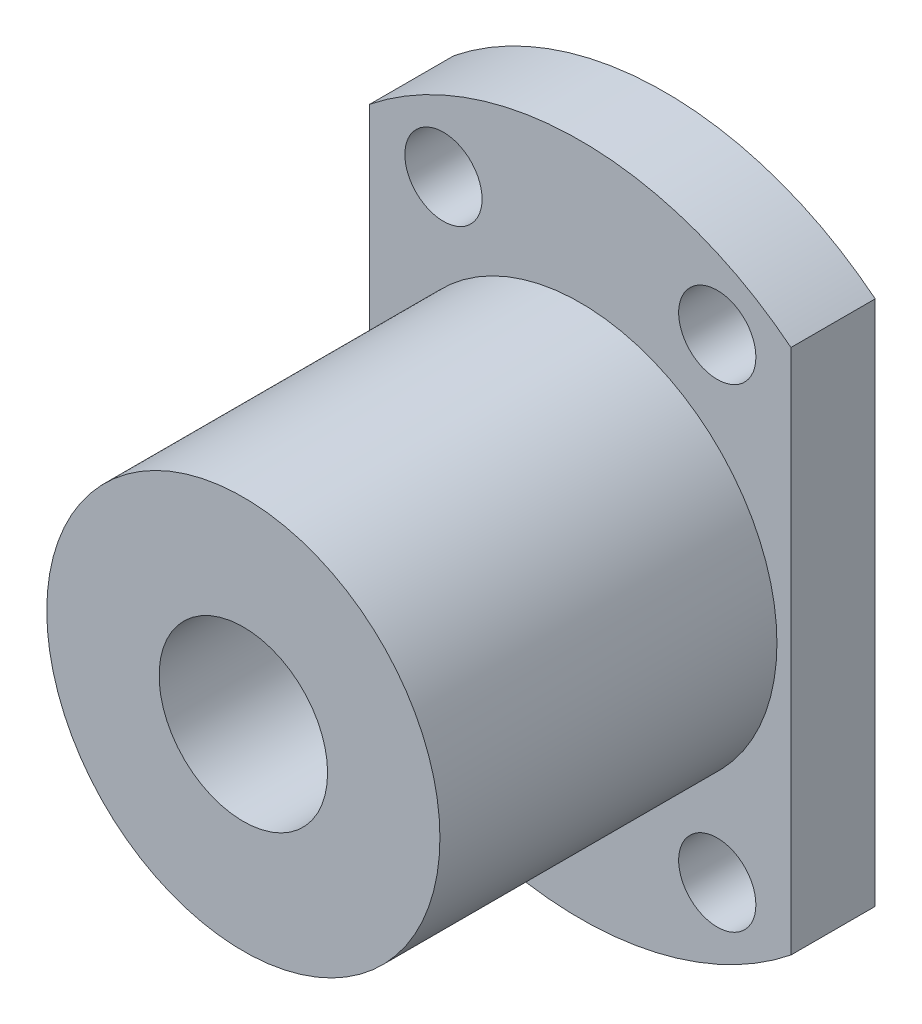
ISO-10303-21;
HEADER;
FILE_DESCRIPTION(('STEP AP214'),'2;1');
FILE_NAME('part.step','',(''),(''),'','','');
FILE_SCHEMA(('AUTOMOTIVE_DESIGN { 1 0 10303 214 1 1 1 1 }'));
ENDSEC;
DATA;
#1=APPLICATION_CONTEXT('core data for automotive mechanical design processes');
#2=APPLICATION_PROTOCOL_DEFINITION('international standard','automotive_design',2000,#1);
#3=PRODUCT_CONTEXT('',#1,'mechanical');
#4=PRODUCT('Part','Part','',(#3));
#5=PRODUCT_RELATED_PRODUCT_CATEGORY('part','',(#4));
#6=PRODUCT_DEFINITION_FORMATION('','',#4);
#7=PRODUCT_DEFINITION_CONTEXT('part definition',#1,'design');
#8=PRODUCT_DEFINITION('design','',#6,#7);
#9=PRODUCT_DEFINITION_SHAPE('','',#8);
#10=(LENGTH_UNIT() NAMED_UNIT(*) SI_UNIT(.MILLI.,.METRE.));
#11=(NAMED_UNIT(*) PLANE_ANGLE_UNIT() SI_UNIT($,.RADIAN.));
#12=(NAMED_UNIT(*) SI_UNIT($,.STERADIAN.) SOLID_ANGLE_UNIT());
#13=UNCERTAINTY_MEASURE_WITH_UNIT(LENGTH_MEASURE(1.E-05),#10,'distance_accuracy_value','');
#14=(GEOMETRIC_REPRESENTATION_CONTEXT(3) GLOBAL_UNCERTAINTY_ASSIGNED_CONTEXT((#13)) GLOBAL_UNIT_ASSIGNED_CONTEXT((#10,
#11,#12)) REPRESENTATION_CONTEXT('',''));
#15=CARTESIAN_POINT('',(0.,0.,0.));
#16=DIRECTION('',(0.,0.,1.));
#17=DIRECTION('',(1.,0.,0.));
#18=AXIS2_PLACEMENT_3D('',#15,#16,#17);
#19=CARTESIAN_POINT('',(0.,0.,-165.));
#20=DIRECTION('',(0.,0.,1.));
#21=DIRECTION('',(1.,0.,0.));
#22=AXIS2_PLACEMENT_3D('',#19,#20,#21);
#23=PLANE('',#22);
#24=CARTESIAN_POINT('',(0.,0.,-165.));
#25=DIRECTION('',(0.,0.,1.));
#26=DIRECTION('',(1.,0.,0.));
#27=AXIS2_PLACEMENT_3D('',#24,#25,#26);
#28=CIRCLE('',#27,6.);
#29=CARTESIAN_POINT('',(6.,0.,-165.));
#30=VERTEX_POINT('',#29);
#31=EDGE_CURVE('E102',#30,#30,#28,.T.);
#32=ORIENTED_EDGE('',*,*,#31,.T.);
#33=EDGE_LOOP('',(#32));
#34=FACE_BOUND('',#33,.T.);
#35=CARTESIAN_POINT('',(0.,0.,-165.));
#36=DIRECTION('',(0.,0.,1.));
#37=DIRECTION('',(1.,0.,0.));
#38=AXIS2_PLACEMENT_3D('',#35,#36,#37);
#39=CIRCLE('',#38,24.);
#40=CARTESIAN_POINT('',(15.,18.7349939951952,-165.));
#41=VERTEX_POINT('',#40);
#42=CARTESIAN_POINT('',(-15.,18.7349939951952,-165.));
#43=VERTEX_POINT('',#42);
#44=EDGE_CURVE('E67',#41,#43,#39,.T.);
#45=ORIENTED_EDGE('',*,*,#44,.F.);
#46=DIRECTION('',(0.,1.,0.));
#47=VECTOR('',#46,1.);
#48=CARTESIAN_POINT('',(15.,-18.7349939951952,-165.));
#49=LINE('',#48,#47);
#50=CARTESIAN_POINT('',(15.,-18.7349939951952,-165.));
#51=VERTEX_POINT('',#50);
#52=EDGE_CURVE('E64',#41,#51,#49,.F.);
#53=ORIENTED_EDGE('',*,*,#52,.T.);
#54=CARTESIAN_POINT('',(0.,0.,-165.));
#55=DIRECTION('',(0.,0.,1.));
#56=DIRECTION('',(1.,0.,0.));
#57=AXIS2_PLACEMENT_3D('',#54,#55,#56);
#58=CIRCLE('',#57,24.);
#59=CARTESIAN_POINT('',(-15.,-18.7349939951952,-165.));
#60=VERTEX_POINT('',#59);
#61=EDGE_CURVE('E19',#60,#51,#58,.T.);
#62=ORIENTED_EDGE('',*,*,#61,.F.);
#63=DIRECTION('',(0.,1.,0.));
#64=VECTOR('',#63,1.);
#65=CARTESIAN_POINT('',(-15.,18.7349939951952,-165.));
#66=LINE('',#65,#64);
#67=EDGE_CURVE('E63',#60,#43,#66,.T.);
#68=ORIENTED_EDGE('',*,*,#67,.T.);
#69=EDGE_LOOP('',(#45,#53,#62,#68));
#70=FACE_BOUND('',#69,.T.);
#71=CARTESIAN_POINT('',(9.75,-16.8874953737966,-165.));
#72=DIRECTION('',(0.,0.,1.));
#73=DIRECTION('',(1.,0.,0.));
#74=AXIS2_PLACEMENT_3D('',#71,#72,#73);
#75=CIRCLE('',#74,2.75);
#76=CARTESIAN_POINT('',(12.5,-16.8874953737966,-165.));
#77=VERTEX_POINT('',#76);
#78=EDGE_CURVE('E114',#77,#77,#75,.T.);
#79=ORIENTED_EDGE('',*,*,#78,.T.);
#80=EDGE_LOOP('',(#79));
#81=FACE_BOUND('',#80,.T.);
#82=CARTESIAN_POINT('',(9.75,16.8874953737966,-165.));
#83=DIRECTION('',(0.,0.,1.));
#84=DIRECTION('',(1.,0.,0.));
#85=AXIS2_PLACEMENT_3D('',#82,#83,#84);
#86=CIRCLE('',#85,2.75);
#87=CARTESIAN_POINT('',(12.5,16.8874953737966,-165.));
#88=VERTEX_POINT('',#87);
#89=EDGE_CURVE('E111',#88,#88,#86,.T.);
#90=ORIENTED_EDGE('',*,*,#89,.T.);
#91=EDGE_LOOP('',(#90));
#92=FACE_BOUND('',#91,.T.);
#93=CARTESIAN_POINT('',(-9.75,16.8874953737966,-165.));
#94=DIRECTION('',(0.,0.,1.));
#95=DIRECTION('',(1.,0.,0.));
#96=AXIS2_PLACEMENT_3D('',#93,#94,#95);
#97=CIRCLE('',#96,2.75);
#98=CARTESIAN_POINT('',(-7.,16.8874953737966,-165.));
#99=VERTEX_POINT('',#98);
#100=EDGE_CURVE('E108',#99,#99,#97,.T.);
#101=ORIENTED_EDGE('',*,*,#100,.T.);
#102=EDGE_LOOP('',(#101));
#103=FACE_BOUND('',#102,.T.);
#104=CARTESIAN_POINT('',(-9.75,-16.8874953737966,-165.));
#105=DIRECTION('',(0.,0.,1.));
#106=DIRECTION('',(1.,0.,0.));
#107=AXIS2_PLACEMENT_3D('',#104,#105,#106);
#108=CIRCLE('',#107,2.75);
#109=CARTESIAN_POINT('',(-7.,-16.8874953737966,-165.));
#110=VERTEX_POINT('',#109);
#111=EDGE_CURVE('E105',#110,#110,#108,.T.);
#112=ORIENTED_EDGE('',*,*,#111,.T.);
#113=EDGE_LOOP('',(#112));
#114=FACE_BOUND('',#113,.T.);
#115=ADVANCED_FACE('F16',(#34,#70,#81,#92,#103,#114),#23,.F.);
#116=CARTESIAN_POINT('',(-15.,18.7349939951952,-159.));
#117=DIRECTION('',(1.,0.,0.));
#118=DIRECTION('',(0.,0.,-1.));
#119=AXIS2_PLACEMENT_3D('',#116,#117,#118);
#120=PLANE('',#119);
#121=DIRECTION('',(0.,0.,1.));
#122=VECTOR('',#121,1.);
#123=CARTESIAN_POINT('',(-15.,-18.7349939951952,-159.));
#124=LINE('',#123,#122);
#125=CARTESIAN_POINT('',(-15.,-18.7349939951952,-159.));
#126=VERTEX_POINT('',#125);
#127=EDGE_CURVE('E62',#126,#60,#124,.F.);
#128=ORIENTED_EDGE('',*,*,#127,.F.);
#129=DIRECTION('',(0.,1.,0.));
#130=VECTOR('',#129,1.);
#131=CARTESIAN_POINT('',(-15.,0.,-159.));
#132=LINE('',#131,#130);
#133=CARTESIAN_POINT('',(-15.,18.7349939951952,-159.));
#134=VERTEX_POINT('',#133);
#135=EDGE_CURVE('E101',#134,#126,#132,.F.);
#136=ORIENTED_EDGE('',*,*,#135,.F.);
#137=DIRECTION('',(0.,0.,1.));
#138=VECTOR('',#137,1.);
#139=CARTESIAN_POINT('',(-15.,18.7349939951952,-159.));
#140=LINE('',#139,#138);
#141=EDGE_CURVE('E116',#43,#134,#140,.T.);
#142=ORIENTED_EDGE('',*,*,#141,.F.);
#143=ORIENTED_EDGE('',*,*,#67,.F.);
#144=EDGE_LOOP('',(#128,#136,#142,#143));
#145=FACE_BOUND('',#144,.T.);
#146=ADVANCED_FACE('F126',(#145),#120,.F.);
#147=CARTESIAN_POINT('',(0.,0.,-159.));
#148=DIRECTION('',(0.,0.,1.));
#149=DIRECTION('',(1.,0.,0.));
#150=AXIS2_PLACEMENT_3D('',#147,#148,#149);
#151=CYLINDRICAL_SURFACE('',#150,24.);
#152=CARTESIAN_POINT('',(0.,0.,-159.));
#153=DIRECTION('',(0.,0.,1.));
#154=DIRECTION('',(1.,0.,0.));
#155=AXIS2_PLACEMENT_3D('',#152,#153,#154);
#156=CIRCLE('',#155,24.);
#157=CARTESIAN_POINT('',(15.,-18.7349939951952,-159.));
#158=VERTEX_POINT('',#157);
#159=EDGE_CURVE('E99',#126,#158,#156,.T.);
#160=ORIENTED_EDGE('',*,*,#159,.F.);
#161=ORIENTED_EDGE('',*,*,#127,.T.);
#162=ORIENTED_EDGE('',*,*,#61,.T.);
#163=DIRECTION('',(0.,0.,1.));
#164=VECTOR('',#163,1.);
#165=CARTESIAN_POINT('',(15.,-18.7349939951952,-159.));
#166=LINE('',#165,#164);
#167=EDGE_CURVE('E61',#51,#158,#166,.T.);
#168=ORIENTED_EDGE('',*,*,#167,.T.);
#169=EDGE_LOOP('',(#160,#161,#162,#168));
#170=FACE_BOUND('',#169,.T.);
#171=ADVANCED_FACE('F59',(#170),#151,.T.);
#172=CARTESIAN_POINT('',(15.,-18.7349939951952,-159.));
#173=DIRECTION('',(-1.,0.,0.));
#174=DIRECTION('',(0.,0.,1.));
#175=AXIS2_PLACEMENT_3D('',#172,#173,#174);
#176=PLANE('',#175);
#177=DIRECTION('',(0.,0.,1.));
#178=VECTOR('',#177,1.);
#179=CARTESIAN_POINT('',(15.,18.7349939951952,-159.));
#180=LINE('',#179,#178);
#181=CARTESIAN_POINT('',(15.,18.7349939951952,-159.));
#182=VERTEX_POINT('',#181);
#183=EDGE_CURVE('E34',#182,#41,#180,.F.);
#184=ORIENTED_EDGE('',*,*,#183,.F.);
#185=DIRECTION('',(0.,1.,0.));
#186=VECTOR('',#185,1.);
#187=CARTESIAN_POINT('',(15.,0.,-159.));
#188=LINE('',#187,#186);
#189=EDGE_CURVE('E71',#158,#182,#188,.T.);
#190=ORIENTED_EDGE('',*,*,#189,.F.);
#191=ORIENTED_EDGE('',*,*,#167,.F.);
#192=ORIENTED_EDGE('',*,*,#52,.F.);
#193=EDGE_LOOP('',(#184,#190,#191,#192));
#194=FACE_BOUND('',#193,.T.);
#195=ADVANCED_FACE('F69',(#194),#176,.F.);
#196=CARTESIAN_POINT('',(0.,0.,-159.));
#197=DIRECTION('',(0.,0.,1.));
#198=DIRECTION('',(1.,0.,0.));
#199=AXIS2_PLACEMENT_3D('',#196,#197,#198);
#200=CYLINDRICAL_SURFACE('',#199,24.);
#201=CARTESIAN_POINT('',(0.,0.,-159.));
#202=DIRECTION('',(0.,0.,1.));
#203=DIRECTION('',(1.,0.,0.));
#204=AXIS2_PLACEMENT_3D('',#201,#202,#203);
#205=CIRCLE('',#204,24.);
#206=EDGE_CURVE('E96',#182,#134,#205,.T.);
#207=ORIENTED_EDGE('',*,*,#206,.F.);
#208=ORIENTED_EDGE('',*,*,#183,.T.);
#209=ORIENTED_EDGE('',*,*,#44,.T.);
#210=ORIENTED_EDGE('',*,*,#141,.T.);
#211=EDGE_LOOP('',(#207,#208,#209,#210));
#212=FACE_BOUND('',#211,.T.);
#213=ADVANCED_FACE('F171',(#212),#200,.T.);
#214=CARTESIAN_POINT('',(9.75,-16.8874953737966,-159.));
#215=DIRECTION('',(0.,0.,1.));
#216=DIRECTION('',(1.,0.,0.));
#217=AXIS2_PLACEMENT_3D('',#214,#215,#216);
#218=CYLINDRICAL_SURFACE('',#217,2.75);
#219=ORIENTED_EDGE('',*,*,#78,.F.);
#220=EDGE_LOOP('',(#219));
#221=FACE_BOUND('',#220,.T.);
#222=CARTESIAN_POINT('',(9.75,-16.8874953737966,-159.));
#223=DIRECTION('',(0.,0.,1.));
#224=DIRECTION('',(1.,0.,0.));
#225=AXIS2_PLACEMENT_3D('',#222,#223,#224);
#226=CIRCLE('',#225,2.75);
#227=CARTESIAN_POINT('',(12.5,-16.8874953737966,-159.));
#228=VERTEX_POINT('',#227);
#229=EDGE_CURVE('E93',#228,#228,#226,.F.);
#230=ORIENTED_EDGE('',*,*,#229,.F.);
#231=EDGE_LOOP('',(#230));
#232=FACE_BOUND('',#231,.T.);
#233=ADVANCED_FACE('F167',(#221,#232),#218,.F.);
#234=CARTESIAN_POINT('',(9.75,16.8874953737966,-159.));
#235=DIRECTION('',(0.,0.,1.));
#236=DIRECTION('',(1.,0.,0.));
#237=AXIS2_PLACEMENT_3D('',#234,#235,#236);
#238=CYLINDRICAL_SURFACE('',#237,2.75);
#239=ORIENTED_EDGE('',*,*,#89,.F.);
#240=EDGE_LOOP('',(#239));
#241=FACE_BOUND('',#240,.T.);
#242=CARTESIAN_POINT('',(9.75,16.8874953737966,-159.));
#243=DIRECTION('',(0.,0.,1.));
#244=DIRECTION('',(1.,0.,0.));
#245=AXIS2_PLACEMENT_3D('',#242,#243,#244);
#246=CIRCLE('',#245,2.75);
#247=CARTESIAN_POINT('',(12.5,16.8874953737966,-159.));
#248=VERTEX_POINT('',#247);
#249=EDGE_CURVE('E90',#248,#248,#246,.F.);
#250=ORIENTED_EDGE('',*,*,#249,.F.);
#251=EDGE_LOOP('',(#250));
#252=FACE_BOUND('',#251,.T.);
#253=ADVANCED_FACE('F163',(#241,#252),#238,.F.);
#254=CARTESIAN_POINT('',(-9.75,16.8874953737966,-159.));
#255=DIRECTION('',(0.,0.,1.));
#256=DIRECTION('',(1.,0.,0.));
#257=AXIS2_PLACEMENT_3D('',#254,#255,#256);
#258=CYLINDRICAL_SURFACE('',#257,2.75);
#259=ORIENTED_EDGE('',*,*,#100,.F.);
#260=EDGE_LOOP('',(#259));
#261=FACE_BOUND('',#260,.T.);
#262=CARTESIAN_POINT('',(-9.75,16.8874953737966,-159.));
#263=DIRECTION('',(0.,0.,1.));
#264=DIRECTION('',(1.,0.,0.));
#265=AXIS2_PLACEMENT_3D('',#262,#263,#264);
#266=CIRCLE('',#265,2.75);
#267=CARTESIAN_POINT('',(-7.,16.8874953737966,-159.));
#268=VERTEX_POINT('',#267);
#269=EDGE_CURVE('E87',#268,#268,#266,.F.);
#270=ORIENTED_EDGE('',*,*,#269,.F.);
#271=EDGE_LOOP('',(#270));
#272=FACE_BOUND('',#271,.T.);
#273=ADVANCED_FACE('F159',(#261,#272),#258,.F.);
#274=CARTESIAN_POINT('',(-9.75,-16.8874953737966,-159.));
#275=DIRECTION('',(0.,0.,1.));
#276=DIRECTION('',(1.,0.,0.));
#277=AXIS2_PLACEMENT_3D('',#274,#275,#276);
#278=CYLINDRICAL_SURFACE('',#277,2.75);
#279=ORIENTED_EDGE('',*,*,#111,.F.);
#280=EDGE_LOOP('',(#279));
#281=FACE_BOUND('',#280,.T.);
#282=CARTESIAN_POINT('',(-9.75,-16.8874953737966,-159.));
#283=DIRECTION('',(0.,0.,1.));
#284=DIRECTION('',(1.,0.,0.));
#285=AXIS2_PLACEMENT_3D('',#282,#283,#284);
#286=CIRCLE('',#285,2.75);
#287=CARTESIAN_POINT('',(-7.,-16.8874953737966,-159.));
#288=VERTEX_POINT('',#287);
#289=EDGE_CURVE('E84',#288,#288,#286,.F.);
#290=ORIENTED_EDGE('',*,*,#289,.F.);
#291=EDGE_LOOP('',(#290));
#292=FACE_BOUND('',#291,.T.);
#293=ADVANCED_FACE('F155',(#281,#292),#278,.F.);
#294=CARTESIAN_POINT('',(0.,0.,-135.));
#295=DIRECTION('',(0.,0.,1.));
#296=DIRECTION('',(1.,0.,0.));
#297=AXIS2_PLACEMENT_3D('',#294,#295,#296);
#298=CYLINDRICAL_SURFACE('',#297,6.);
#299=ORIENTED_EDGE('',*,*,#31,.F.);
#300=EDGE_LOOP('',(#299));
#301=FACE_BOUND('',#300,.T.);
#302=CARTESIAN_POINT('',(0.,0.,-135.));
#303=DIRECTION('',(0.,0.,1.));
#304=DIRECTION('',(1.,0.,0.));
#305=AXIS2_PLACEMENT_3D('',#302,#303,#304);
#306=CIRCLE('',#305,6.);
#307=CARTESIAN_POINT('',(6.,0.,-135.));
#308=VERTEX_POINT('',#307);
#309=EDGE_CURVE('E81',#308,#308,#306,.F.);
#310=ORIENTED_EDGE('',*,*,#309,.F.);
#311=EDGE_LOOP('',(#310));
#312=FACE_BOUND('',#311,.T.);
#313=ADVANCED_FACE('F151',(#301,#312),#298,.F.);
#314=CARTESIAN_POINT('',(0.,0.,-159.));
#315=DIRECTION('',(0.,0.,1.));
#316=DIRECTION('',(1.,0.,0.));
#317=AXIS2_PLACEMENT_3D('',#314,#315,#316);
#318=PLANE('',#317);
#319=CARTESIAN_POINT('',(0.,0.,-159.));
#320=DIRECTION('',(0.,0.,1.));
#321=DIRECTION('',(1.,0.,0.));
#322=AXIS2_PLACEMENT_3D('',#319,#320,#321);
#323=CIRCLE('',#322,14.);
#324=CARTESIAN_POINT('',(14.,0.,-159.));
#325=VERTEX_POINT('',#324);
#326=EDGE_CURVE('E25',#325,#325,#323,.T.);
#327=ORIENTED_EDGE('',*,*,#326,.F.);
#328=EDGE_LOOP('',(#327));
#329=FACE_BOUND('',#328,.T.);
#330=ORIENTED_EDGE('',*,*,#289,.T.);
#331=EDGE_LOOP('',(#330));
#332=FACE_BOUND('',#331,.T.);
#333=ORIENTED_EDGE('',*,*,#269,.T.);
#334=EDGE_LOOP('',(#333));
#335=FACE_BOUND('',#334,.T.);
#336=ORIENTED_EDGE('',*,*,#249,.T.);
#337=EDGE_LOOP('',(#336));
#338=FACE_BOUND('',#337,.T.);
#339=ORIENTED_EDGE('',*,*,#229,.T.);
#340=EDGE_LOOP('',(#339));
#341=FACE_BOUND('',#340,.T.);
#342=ORIENTED_EDGE('',*,*,#189,.T.);
#343=ORIENTED_EDGE('',*,*,#206,.T.);
#344=ORIENTED_EDGE('',*,*,#135,.T.);
#345=ORIENTED_EDGE('',*,*,#159,.T.);
#346=EDGE_LOOP('',(#342,#343,#344,#345));
#347=FACE_BOUND('',#346,.T.);
#348=ADVANCED_FACE('F124',(#329,#332,#335,#338,#341,#347),#318,.T.);
#349=CARTESIAN_POINT('',(0.,0.,-135.));
#350=DIRECTION('',(0.,0.,1.));
#351=DIRECTION('',(1.,0.,0.));
#352=AXIS2_PLACEMENT_3D('',#349,#350,#351);
#353=PLANE('',#352);
#354=ORIENTED_EDGE('',*,*,#309,.T.);
#355=EDGE_LOOP('',(#354));
#356=FACE_BOUND('',#355,.T.);
#357=CARTESIAN_POINT('',(0.,0.,-135.));
#358=DIRECTION('',(0.,0.,1.));
#359=DIRECTION('',(1.,0.,0.));
#360=AXIS2_PLACEMENT_3D('',#357,#358,#359);
#361=CIRCLE('',#360,14.);
#362=CARTESIAN_POINT('',(14.,0.,-135.));
#363=VERTEX_POINT('',#362);
#364=EDGE_CURVE('E11',#363,#363,#361,.F.);
#365=ORIENTED_EDGE('',*,*,#364,.F.);
#366=EDGE_LOOP('',(#365));
#367=FACE_BOUND('',#366,.T.);
#368=ADVANCED_FACE('F138',(#356,#367),#353,.T.);
#369=CARTESIAN_POINT('',(0.,0.,-135.));
#370=DIRECTION('',(0.,0.,1.));
#371=DIRECTION('',(1.,0.,0.));
#372=AXIS2_PLACEMENT_3D('',#369,#370,#371);
#373=CYLINDRICAL_SURFACE('',#372,14.);
#374=ORIENTED_EDGE('',*,*,#364,.T.);
#375=EDGE_LOOP('',(#374));
#376=FACE_BOUND('',#375,.T.);
#377=ORIENTED_EDGE('',*,*,#326,.T.);
#378=EDGE_LOOP('',(#377));
#379=FACE_BOUND('',#378,.T.);
#380=ADVANCED_FACE('F136',(#376,#379),#373,.T.);
#381=CLOSED_SHELL('',(#115,#146,#171,#195,#213,#233,#253,#273,#293,#313,#348,#368,#380));
#382=MANIFOLD_SOLID_BREP('B1',#381);
#383=ADVANCED_BREP_SHAPE_REPRESENTATION('',(#18,#382),#14);
#384=SHAPE_DEFINITION_REPRESENTATION(#9,#383);
ENDSEC;
END-ISO-10303-21;
